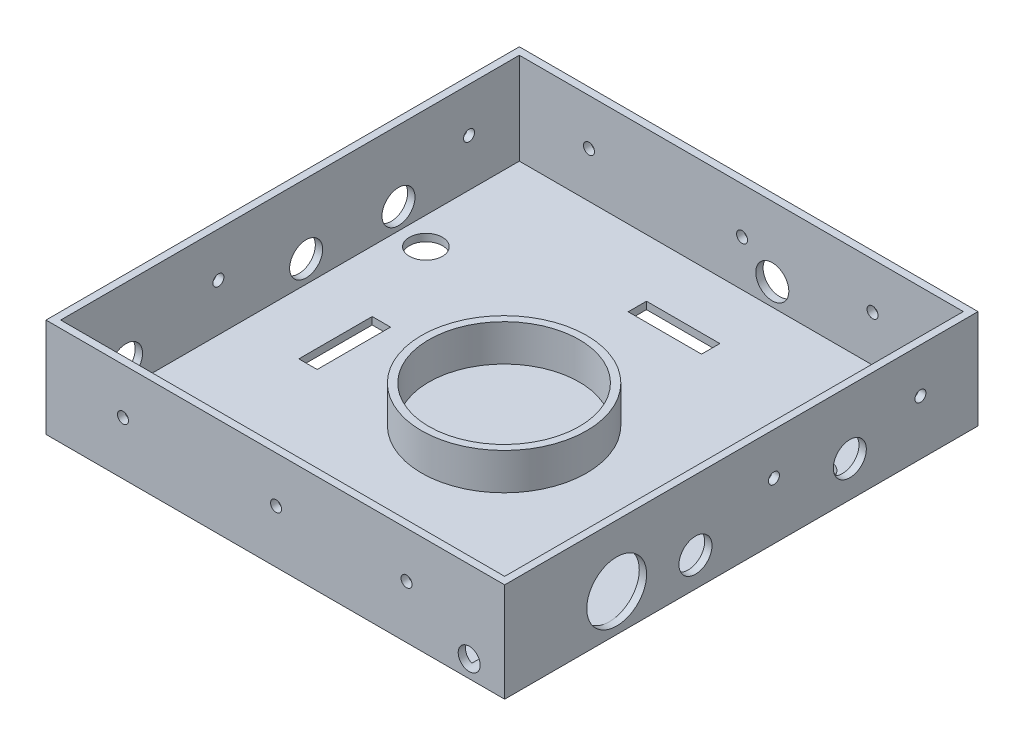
from build123d import *

# Parameters (mm, degrees)
SKETCH_1_W           = 100
SKETCH_1_H           = 100
EXTRUDE_1_DEPTH      = 2
SKETCH_2_W           = 210
SKETCH_2_H           = 210
SKETCH_2_W_2         = 100
SKETCH_2_H_2         = 100
EXTRUDE_2_DEPTH      = 3
SKETCH_3_W           = 210
SKETCH_3_H           = 210
CUT_EXTRUDE_1_DEPTH  = 1
CUT_EXTRUDE_3_DEPTH  = 2
CUT_EXTRUDE_4_DEPTH  = 2
SKETCH_8_R           = 22.5
EXTRUDE_3_DEPTH      = 10
SKETCH_9_R           = 20.5
CUT_EXTRUDE_5_DEPTH  = 10
EXTRUDE_4_DEPTH      = 25
SKETCH_11_R          = 8.153991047
SKETCH_11_R_2        = 4.5
CUT_EXTRUDE_6_DEPTH  = 25
SKETCH_12_R          = 4.5
CUT_EXTRUDE_7_DEPTH  = 25
SKETCH_13_R          = 4.5
CUT_EXTRUDE_8_DEPTH  = 25
SKETCH_14_R          = 4.5
CUT_EXTRUDE_9_DEPTH  = 25
SKETCH_15_W          = 20
SKETCH_15_H          = 5
CUT_EXTRUDE_10_DEPTH = 25
SKETCH_16_R          = 1.5
CUT_EXTRUDE_11_DEPTH = 142
SKETCH_17_R          = 1.5
CUT_EXTRUDE_12_DEPTH = 98
CUT_EXTRUDE_START    = -98
SKETCH_18_R          = 1.5
CUT_EXTRUDE_13_DEPTH = 98
SKETCH_19_W          = 5
SKETCH_19_H          = 20
CUT_EXTRUDE_14_DEPTH = 98
SKETCH_20_R          = 3
CUT_EXTRUDE_15_DEPTH = 10


with BuildPart() as part:
    # Sketch 1 → Extrude 1 (new body)
    with BuildSketch(Plane(origin=(0, 0, 0), x_dir=(1, 0, 0), z_dir=(0, 1, 0))):
        with Locations((50, 50)):
            Rectangle(SKETCH_1_W, SKETCH_1_H)
    extrude(amount=EXTRUDE_1_DEPTH)

    # Sketch 2 → Extrude 2 (add)
    with BuildSketch(Plane(origin=(0, 2, 0), x_dir=(1, 0, 0), z_dir=(0, 1, 0))):
        with Locations((50, 50)):
            Rectangle(SKETCH_2_W, SKETCH_2_H)
        with Locations((50, 50)):
            Rectangle(SKETCH_2_W_2, SKETCH_2_H_2, mode=Mode.SUBTRACT)
    extrude(amount=-EXTRUDE_2_DEPTH)

    # Sketch 3 → Cut-Extrude 1 (cut)
    with BuildSketch(Plane.XZ.offset(1)):
        with Locations((50, -50)):
            Rectangle(SKETCH_3_W, SKETCH_3_H)
    extrude(amount=-CUT_EXTRUDE_1_DEPTH, mode=Mode.SUBTRACT)

    # Sketch 4 → Cut-Extrude 3 (cut)
    with BuildSketch(Plane(origin=(0, 2, 0), x_dir=(1, 0, 0), z_dir=(0, 1, 0))):
        Polygon((85, 85), (85, -55), (155, -55), (155, 155), (-55, 155), (-55, 85), align=None)
    extrude(amount=-CUT_EXTRUDE_3_DEPTH, mode=Mode.SUBTRACT)

    # Sketch 6 → Cut-Extrude 4 (cut)
    with BuildSketch(Plane(origin=(0, 2, 0), x_dir=(1, 0, 0), z_dir=(0, 1, 0))):
        Polygon((70, 74), (70, -55), (85, -55), (85, 85), (-55, 85), (-55, 74), align=None)
    extrude(amount=-CUT_EXTRUDE_4_DEPTH, mode=Mode.SUBTRACT)

    # Sketch 8 → Extrude 3 (add)
    with BuildSketch(Plane(origin=(0, 2, 0), x_dir=(1, 0, 0), z_dir=(0, 1, 0))):
        with Locations(Location((7.297464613, 7.547564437, 0), (0, 0, 270))):
            Circle(SKETCH_8_R)
    extrude(amount=EXTRUDE_3_DEPTH)

    # Sketch 9 → Cut-Extrude 5 (cut)
    with BuildSketch(Plane(origin=(0, 12, 0), x_dir=(1, 0, 0), z_dir=(0, 1, 0))):
        with Locations(Location((7.297464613, 7.547564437, 0), (0, 0, 270))):
            Circle(SKETCH_9_R)
    extrude(amount=-CUT_EXTRUDE_5_DEPTH, mode=Mode.SUBTRACT)

    # Sketch 10 → Extrude 4 (add)
    with BuildSketch(Plane(origin=(0, 2, 0), x_dir=(1, 0, 0), z_dir=(0, 1, 0))):
        Polygon((68, 71.936), (70, 74), (-55, 74), (-55, -55), (-53, -52.936), (-53, 72), (68, 72), align=None)
        Polygon((70, -55), (70, 74), (68, 71.936), (68, -53), (-53, -53), (-53, -52.936), (-55, -55), align=None)
    extrude(amount=EXTRUDE_4_DEPTH)

    # Sketch 11 → Cut-Extrude 6 (cut)
    with BuildSketch(Plane(origin=(70, 0, 0), x_dir=(0, 0, -1), z_dir=(1, 0, 0))):
        with Locations((-24.46888303, 10.181268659)):
            Circle(SKETCH_11_R)
        with Locations((-2.990499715, 8)):
            Circle(SKETCH_11_R_2)
        with Locations((39.067208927, 9.751381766)):
            Circle(SKETCH_11_R_2)
    extrude(amount=-CUT_EXTRUDE_6_DEPTH, mode=Mode.SUBTRACT)

    # Sketch 12 → Cut-Extrude 7 (cut)
    with BuildSketch(Plane.ZY.offset(55)):
        with Locations((35.190278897, 8.021965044)):
            Circle(SKETCH_12_R)
        with Locations((-13.893227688, 8)):
            Circle(SKETCH_12_R)
        with Locations((-39.067208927, 7.751381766)):
            Circle(SKETCH_12_R)
    extrude(amount=-CUT_EXTRUDE_7_DEPTH, mode=Mode.SUBTRACT)

    # Sketch 13 → Cut-Extrude 8 (cut)
    with BuildSketch(Plane(origin=(0, 0, -74), x_dir=(-1, 0, 0), z_dir=(0, 0, -1))):
        with Locations((-15.938248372, 8)):
            Circle(SKETCH_13_R)
    extrude(amount=-CUT_EXTRUDE_8_DEPTH, mode=Mode.SUBTRACT)

    # Sketch 14 → Cut-Extrude 9 (cut)
    with BuildSketch(Plane.XZ):
        with Locations(Location((60.135335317, -39.051768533, 0), (0, 0, 270))):
            Circle(SKETCH_14_R)
        with Locations(Location((-45.525481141, -39.067208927, 0), (0, 0, 270))):
            Circle(SKETCH_14_R)
    extrude(amount=-CUT_EXTRUDE_9_DEPTH, mode=Mode.SUBTRACT)

    # Sketch 15 → Cut-Extrude 10 (cut)
    with BuildSketch(Plane(origin=(0, 2, 0), x_dir=(1, 0, 0), z_dir=(0, 1, 0))):
        with Locations((7.376614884, 53.773760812)):
            Rectangle(SKETCH_15_W, SKETCH_15_H)
    extrude(amount=-CUT_EXTRUDE_10_DEPTH, mode=Mode.SUBTRACT)

    # Sketch 16 → Cut-Extrude 11 (cut)
    with BuildSketch(Plane.XY.offset(55)):
        with Locations((7.700039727, 14.458121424)):
            Circle(SKETCH_16_R)
        with Locations((-34.018321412, 14.458121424)):
            Circle(SKETCH_16_R)
        with Locations((43.259318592, 14.458121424)):
            Circle(SKETCH_16_R)
    extrude(amount=-CUT_EXTRUDE_11_DEPTH, mode=Mode.SUBTRACT)

    # Sketch 17 → Cut-Extrude 12 (cut)
    with BuildSketch(Plane.ZY.offset(55)):
        with Locations((-58.304301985, 14.911689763)):
            Circle(SKETCH_17_R)
        with Locations((10.009043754, 14.911689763)):
            Circle(SKETCH_17_R)
    extrude(amount=-CUT_EXTRUDE_12_DEPTH, mode=Mode.SUBTRACT)

    # Sketch 18 → Cut-Extrude 13 (cut)
    with BuildSketch(Plane(origin=(70, 0, 0), x_dir=(0, 0, -1), z_dir=(1, 0, 0)).offset(CUT_EXTRUDE_START)):
        with Locations((18.393227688, 15.475733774)):
            Circle(SKETCH_18_R)
        with Locations(Location((58.304301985, 14.911689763, 0), (0, 0, 180))):
            Circle(SKETCH_18_R)
    extrude(amount=CUT_EXTRUDE_13_DEPTH, mode=Mode.SUBTRACT)

    # Sketch 19 → Cut-Extrude 14 (cut)
    with BuildSketch(Plane(origin=(0, 2, 0), x_dir=(1, 0, 0), z_dir=(0, 1, 0))):
        with Locations((49.459355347, 6.224583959)):
            Rectangle(SKETCH_19_W, SKETCH_19_H)
        with Locations((-33.884328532, 5.281486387)):
            Rectangle(SKETCH_19_W, SKETCH_19_H)
    extrude(amount=-CUT_EXTRUDE_14_DEPTH, mode=Mode.SUBTRACT)

    # Sketch 20 → Cut-Extrude 15 (cut)
    with BuildSketch(Plane.XY.offset(55)):
        with Locations((60.335375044, 4.694530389)):
            Circle(SKETCH_20_R)
    extrude(amount=-CUT_EXTRUDE_15_DEPTH, mode=Mode.SUBTRACT)


solid = part.part
